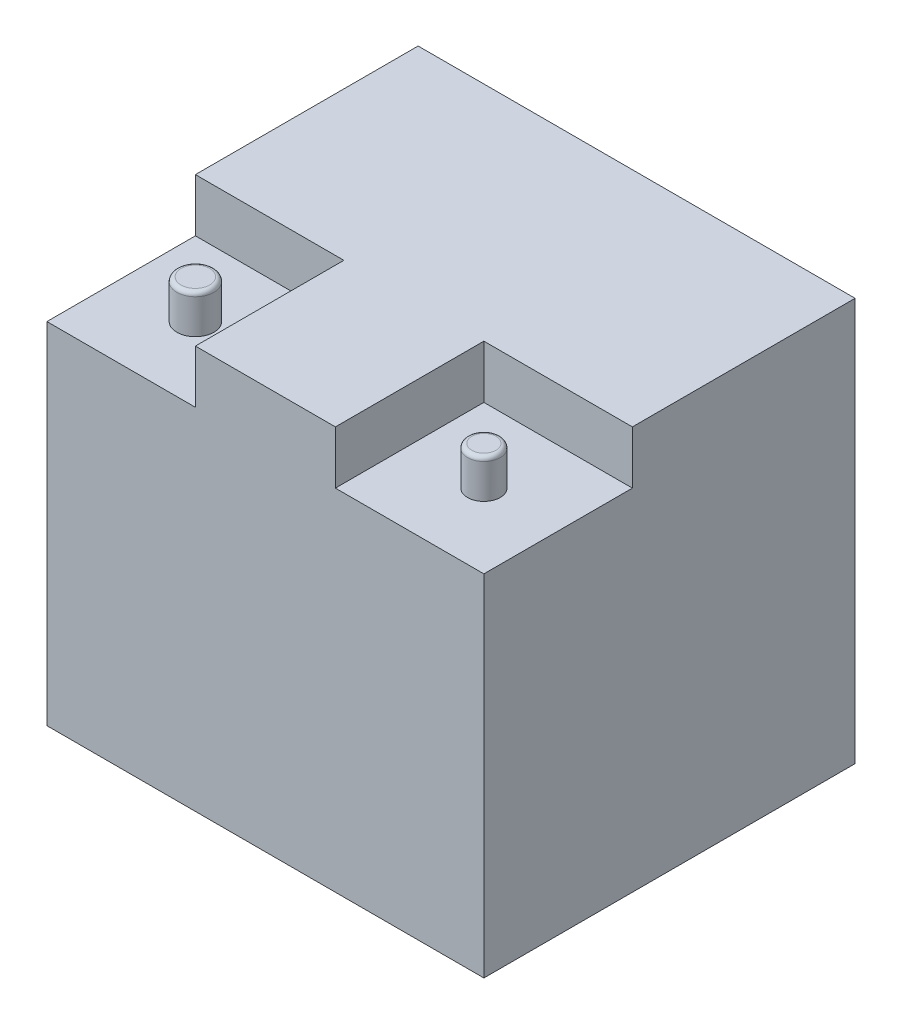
from build123d import *

# Parameters (mm, degrees)
ESQUISSE1_W             = 206
ESQUISSE1_H             = 175
EXTRUSION1_DEPTH        = 190
ESQUISSE2_W             = 70
ESQUISSE2_H             = 70
ENL_V_MAT_EXTRU_1_DEPTH = 25
ESQUISSE3_R             = 8.75
ESQUISSE3_R_2           = 7.7
EXTRUSION2_DEPTH        = 18.3
CONG_1_R                = 2


with BuildPart() as part:
    # Esquisse1 → Extrusion1 (new body)
    with BuildSketch(Plane(origin=(0, 0, 0), x_dir=(1, 0, 0), z_dir=(0, 1, 0))):
        Rectangle(ESQUISSE1_W, ESQUISSE1_H)
    extrude(amount=EXTRUSION1_DEPTH)

    # Esquisse2 → Enl_v. mat.-Extru.1 (cut)
    with BuildSketch(Plane(origin=(0, 190, 0), x_dir=(-1, 0, 0), z_dir=(0, 1, 0))):
        with Locations((68, 52.5)):
            Rectangle(ESQUISSE2_W, ESQUISSE2_H)
        with Locations((-68, 52.5)):
            Rectangle(ESQUISSE2_W, ESQUISSE2_H)
    extrude(amount=-ENL_V_MAT_EXTRU_1_DEPTH, mode=Mode.SUBTRACT)

    # Esquisse3 → Extrusion2 (add)
    with BuildSketch(Plane(origin=(0, 165, 0), x_dir=(-1, 0, 0), z_dir=(0, 1, 0))):
        with Locations(Location((68, 52.5, 0), (0, 0, 270))):
            Circle(ESQUISSE3_R)
        with Locations(Location((-68, 52.5, 0), (0, 0, 270))):
            Circle(ESQUISSE3_R_2)
    extrude(amount=EXTRUSION2_DEPTH)

    # Cong_1
    cong_1_edges = [part.edges().sort_by_distance(p)[0] for p in [
        (-68, 183.3, 61.25),
        (68, 183.3, 60.2),
    ]]
    fillet(cong_1_edges, radius=CONG_1_R)


solid = part.part
